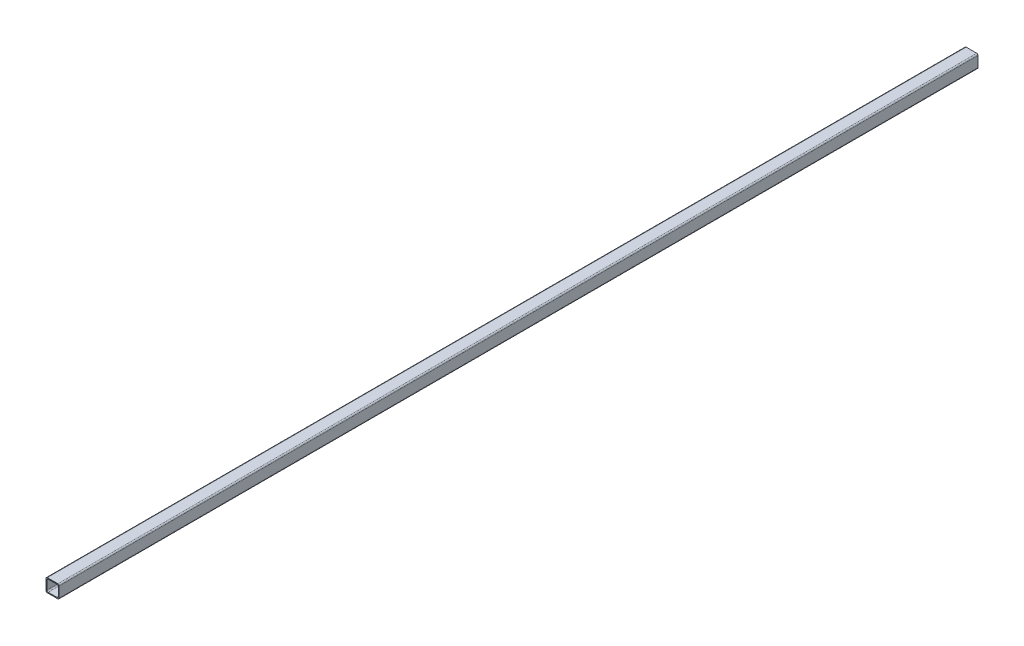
ISO-10303-21;
HEADER;
FILE_DESCRIPTION(('STEP AP214'),'2;1');
FILE_NAME('part.step','',(''),(''),'','','');
FILE_SCHEMA(('AUTOMOTIVE_DESIGN { 1 0 10303 214 1 1 1 1 }'));
ENDSEC;
DATA;
#1=APPLICATION_CONTEXT('core data for automotive mechanical design processes');
#2=APPLICATION_PROTOCOL_DEFINITION('international standard','automotive_design',2000,#1);
#3=PRODUCT_CONTEXT('',#1,'mechanical');
#4=PRODUCT('Part','Part','',(#3));
#5=PRODUCT_RELATED_PRODUCT_CATEGORY('part','',(#4));
#6=PRODUCT_DEFINITION_FORMATION('','',#4);
#7=PRODUCT_DEFINITION_CONTEXT('part definition',#1,'design');
#8=PRODUCT_DEFINITION('design','',#6,#7);
#9=PRODUCT_DEFINITION_SHAPE('','',#8);
#10=(LENGTH_UNIT() NAMED_UNIT(*) SI_UNIT(.MILLI.,.METRE.));
#11=(NAMED_UNIT(*) PLANE_ANGLE_UNIT() SI_UNIT($,.RADIAN.));
#12=(NAMED_UNIT(*) SI_UNIT($,.STERADIAN.) SOLID_ANGLE_UNIT());
#13=UNCERTAINTY_MEASURE_WITH_UNIT(LENGTH_MEASURE(1.E-05),#10,'distance_accuracy_value','');
#14=(GEOMETRIC_REPRESENTATION_CONTEXT(3) GLOBAL_UNCERTAINTY_ASSIGNED_CONTEXT((#13)) GLOBAL_UNIT_ASSIGNED_CONTEXT((#10,
#11,#12)) REPRESENTATION_CONTEXT('',''));
#15=CARTESIAN_POINT('',(0.,0.,0.));
#16=DIRECTION('',(0.,0.,1.));
#17=DIRECTION('',(1.,0.,0.));
#18=AXIS2_PLACEMENT_3D('',#15,#16,#17);
#19=CARTESIAN_POINT('',(0.,0.,2100.));
#20=DIRECTION('',(0.,0.,1.));
#21=DIRECTION('',(1.,0.,0.));
#22=AXIS2_PLACEMENT_3D('',#19,#20,#21);
#23=PLANE('',#22);
#24=DIRECTION('',(0.,-1.,0.));
#25=VECTOR('',#24,1.);
#26=CARTESIAN_POINT('',(0.,0.,2100.));
#27=LINE('',#26,#25);
#28=CARTESIAN_POINT('',(0.,27.,2100.));
#29=VERTEX_POINT('',#28);
#30=CARTESIAN_POINT('',(0.,3.,2100.));
#31=VERTEX_POINT('',#30);
#32=EDGE_CURVE('E218',#29,#31,#27,.T.);
#33=ORIENTED_EDGE('',*,*,#32,.T.);
#34=CARTESIAN_POINT('',(3.,3.,2100.));
#35=DIRECTION('',(0.,0.,1.));
#36=DIRECTION('',(1.,0.,0.));
#37=AXIS2_PLACEMENT_3D('',#34,#35,#36);
#38=CIRCLE('',#37,3.);
#39=CARTESIAN_POINT('',(3.,0.,2100.));
#40=VERTEX_POINT('',#39);
#41=EDGE_CURVE('E237',#31,#40,#38,.T.);
#42=ORIENTED_EDGE('',*,*,#41,.T.);
#43=DIRECTION('',(1.,0.,0.));
#44=VECTOR('',#43,1.);
#45=CARTESIAN_POINT('',(0.,0.,2100.));
#46=LINE('',#45,#44);
#47=CARTESIAN_POINT('',(27.,0.,2100.));
#48=VERTEX_POINT('',#47);
#49=EDGE_CURVE('E198',#40,#48,#46,.T.);
#50=ORIENTED_EDGE('',*,*,#49,.T.);
#51=CARTESIAN_POINT('',(27.,3.,2100.));
#52=DIRECTION('',(0.,0.,1.));
#53=DIRECTION('',(1.,0.,0.));
#54=AXIS2_PLACEMENT_3D('',#51,#52,#53);
#55=CIRCLE('',#54,3.);
#56=CARTESIAN_POINT('',(30.,3.,2100.));
#57=VERTEX_POINT('',#56);
#58=EDGE_CURVE('E235',#48,#57,#55,.T.);
#59=ORIENTED_EDGE('',*,*,#58,.T.);
#60=DIRECTION('',(0.,1.,0.));
#61=VECTOR('',#60,1.);
#62=CARTESIAN_POINT('',(30.,0.,2100.));
#63=LINE('',#62,#61);
#64=CARTESIAN_POINT('',(30.,27.,2100.));
#65=VERTEX_POINT('',#64);
#66=EDGE_CURVE('E326',#57,#65,#63,.T.);
#67=ORIENTED_EDGE('',*,*,#66,.T.);
#68=CARTESIAN_POINT('',(27.,27.,2100.));
#69=DIRECTION('',(0.,0.,1.));
#70=DIRECTION('',(1.,0.,0.));
#71=AXIS2_PLACEMENT_3D('',#68,#69,#70);
#72=CIRCLE('',#71,3.);
#73=CARTESIAN_POINT('',(27.,30.,2100.));
#74=VERTEX_POINT('',#73);
#75=EDGE_CURVE('E233',#65,#74,#72,.T.);
#76=ORIENTED_EDGE('',*,*,#75,.T.);
#77=DIRECTION('',(-1.,0.,0.));
#78=VECTOR('',#77,1.);
#79=CARTESIAN_POINT('',(0.,30.,2100.));
#80=LINE('',#79,#78);
#81=CARTESIAN_POINT('',(3.,30.,2100.));
#82=VERTEX_POINT('',#81);
#83=EDGE_CURVE('E220',#74,#82,#80,.T.);
#84=ORIENTED_EDGE('',*,*,#83,.T.);
#85=CARTESIAN_POINT('',(3.,27.,2100.));
#86=DIRECTION('',(0.,0.,1.));
#87=DIRECTION('',(1.,0.,0.));
#88=AXIS2_PLACEMENT_3D('',#85,#86,#87);
#89=CIRCLE('',#88,3.);
#90=EDGE_CURVE('E231',#82,#29,#89,.T.);
#91=ORIENTED_EDGE('',*,*,#90,.T.);
#92=EDGE_LOOP('',(#33,#42,#50,#59,#67,#76,#84,#91));
#93=FACE_BOUND('',#92,.T.);
#94=DIRECTION('',(1.,0.,0.));
#95=VECTOR('',#94,1.);
#96=CARTESIAN_POINT('',(0.,2.,2100.));
#97=LINE('',#96,#95);
#98=CARTESIAN_POINT('',(5.,2.,2100.));
#99=VERTEX_POINT('',#98);
#100=CARTESIAN_POINT('',(25.,2.,2100.));
#101=VERTEX_POINT('',#100);
#102=EDGE_CURVE('E307',#99,#101,#97,.T.);
#103=ORIENTED_EDGE('',*,*,#102,.F.);
#104=CARTESIAN_POINT('',(5.,5.,2100.));
#105=DIRECTION('',(0.,0.,1.));
#106=DIRECTION('',(1.,0.,0.));
#107=AXIS2_PLACEMENT_3D('',#104,#105,#106);
#108=CIRCLE('',#107,3.);
#109=CARTESIAN_POINT('',(2.,5.,2100.));
#110=VERTEX_POINT('',#109);
#111=EDGE_CURVE('E12',#99,#110,#108,.F.);
#112=ORIENTED_EDGE('',*,*,#111,.T.);
#113=DIRECTION('',(0.,-1.,0.));
#114=VECTOR('',#113,1.);
#115=CARTESIAN_POINT('',(2.,30.,2100.));
#116=LINE('',#115,#114);
#117=CARTESIAN_POINT('',(2.,25.,2100.));
#118=VERTEX_POINT('',#117);
#119=EDGE_CURVE('E305',#118,#110,#116,.T.);
#120=ORIENTED_EDGE('',*,*,#119,.F.);
#121=CARTESIAN_POINT('',(5.,25.,2100.));
#122=DIRECTION('',(0.,0.,1.));
#123=DIRECTION('',(1.,0.,0.));
#124=AXIS2_PLACEMENT_3D('',#121,#122,#123);
#125=CIRCLE('',#124,3.);
#126=CARTESIAN_POINT('',(5.,28.,2100.));
#127=VERTEX_POINT('',#126);
#128=EDGE_CURVE('E283',#118,#127,#125,.F.);
#129=ORIENTED_EDGE('',*,*,#128,.T.);
#130=DIRECTION('',(-1.,0.,0.));
#131=VECTOR('',#130,1.);
#132=CARTESIAN_POINT('',(0.,28.,2100.));
#133=LINE('',#132,#131);
#134=CARTESIAN_POINT('',(25.,28.,2100.));
#135=VERTEX_POINT('',#134);
#136=EDGE_CURVE('E212',#135,#127,#133,.T.);
#137=ORIENTED_EDGE('',*,*,#136,.F.);
#138=CARTESIAN_POINT('',(25.,25.,2100.));
#139=DIRECTION('',(0.,0.,1.));
#140=DIRECTION('',(1.,0.,0.));
#141=AXIS2_PLACEMENT_3D('',#138,#139,#140);
#142=CIRCLE('',#141,3.);
#143=CARTESIAN_POINT('',(28.,25.,2100.));
#144=VERTEX_POINT('',#143);
#145=EDGE_CURVE('E79',#135,#144,#142,.F.);
#146=ORIENTED_EDGE('',*,*,#145,.T.);
#147=DIRECTION('',(0.,1.,0.));
#148=VECTOR('',#147,1.);
#149=CARTESIAN_POINT('',(28.,30.,2100.));
#150=LINE('',#149,#148);
#151=CARTESIAN_POINT('',(28.,5.,2100.));
#152=VERTEX_POINT('',#151);
#153=EDGE_CURVE('E313',#152,#144,#150,.T.);
#154=ORIENTED_EDGE('',*,*,#153,.F.);
#155=CARTESIAN_POINT('',(25.,5.,2100.));
#156=DIRECTION('',(0.,0.,1.));
#157=DIRECTION('',(1.,0.,0.));
#158=AXIS2_PLACEMENT_3D('',#155,#156,#157);
#159=CIRCLE('',#158,3.);
#160=EDGE_CURVE('E276',#152,#101,#159,.F.);
#161=ORIENTED_EDGE('',*,*,#160,.T.);
#162=EDGE_LOOP('',(#103,#112,#120,#129,#137,#146,#154,#161));
#163=FACE_BOUND('',#162,.T.);
#164=ADVANCED_FACE('F64',(#93,#163),#23,.T.);
#165=CARTESIAN_POINT('',(0.,0.,0.));
#166=DIRECTION('',(0.,0.,1.));
#167=DIRECTION('',(1.,0.,0.));
#168=AXIS2_PLACEMENT_3D('',#165,#166,#167);
#169=PLANE('',#168);
#170=DIRECTION('',(1.,0.,0.));
#171=VECTOR('',#170,1.);
#172=CARTESIAN_POINT('',(0.,0.,0.));
#173=LINE('',#172,#171);
#174=CARTESIAN_POINT('',(3.,0.,0.));
#175=VERTEX_POINT('',#174);
#176=CARTESIAN_POINT('',(27.,0.,0.));
#177=VERTEX_POINT('',#176);
#178=EDGE_CURVE('E195',#175,#177,#173,.T.);
#179=ORIENTED_EDGE('',*,*,#178,.F.);
#180=CARTESIAN_POINT('',(3.,3.,0.));
#181=DIRECTION('',(0.,0.,1.));
#182=DIRECTION('',(1.,0.,0.));
#183=AXIS2_PLACEMENT_3D('',#180,#181,#182);
#184=CIRCLE('',#183,3.);
#185=CARTESIAN_POINT('',(0.,3.,0.));
#186=VERTEX_POINT('',#185);
#187=EDGE_CURVE('E178',#175,#186,#184,.F.);
#188=ORIENTED_EDGE('',*,*,#187,.T.);
#189=DIRECTION('',(0.,-1.,0.));
#190=VECTOR('',#189,1.);
#191=CARTESIAN_POINT('',(0.,0.,0.));
#192=LINE('',#191,#190);
#193=CARTESIAN_POINT('',(0.,27.,0.));
#194=VERTEX_POINT('',#193);
#195=EDGE_CURVE('E207',#194,#186,#192,.T.);
#196=ORIENTED_EDGE('',*,*,#195,.F.);
#197=CARTESIAN_POINT('',(3.,27.,0.));
#198=DIRECTION('',(0.,0.,1.));
#199=DIRECTION('',(1.,0.,0.));
#200=AXIS2_PLACEMENT_3D('',#197,#198,#199);
#201=CIRCLE('',#200,3.);
#202=CARTESIAN_POINT('',(3.,30.,0.));
#203=VERTEX_POINT('',#202);
#204=EDGE_CURVE('E200',#194,#203,#201,.F.);
#205=ORIENTED_EDGE('',*,*,#204,.T.);
#206=DIRECTION('',(-1.,0.,0.));
#207=VECTOR('',#206,1.);
#208=CARTESIAN_POINT('',(0.,30.,0.));
#209=LINE('',#208,#207);
#210=CARTESIAN_POINT('',(27.,30.,0.));
#211=VERTEX_POINT('',#210);
#212=EDGE_CURVE('E210',#211,#203,#209,.T.);
#213=ORIENTED_EDGE('',*,*,#212,.F.);
#214=CARTESIAN_POINT('',(27.,27.,0.));
#215=DIRECTION('',(0.,0.,1.));
#216=DIRECTION('',(1.,0.,0.));
#217=AXIS2_PLACEMENT_3D('',#214,#215,#216);
#218=CIRCLE('',#217,3.);
#219=CARTESIAN_POINT('',(30.,27.,0.));
#220=VERTEX_POINT('',#219);
#221=EDGE_CURVE('E223',#211,#220,#218,.F.);
#222=ORIENTED_EDGE('',*,*,#221,.T.);
#223=DIRECTION('',(0.,1.,0.));
#224=VECTOR('',#223,1.);
#225=CARTESIAN_POINT('',(30.,0.,0.));
#226=LINE('',#225,#224);
#227=CARTESIAN_POINT('',(30.,3.,0.));
#228=VERTEX_POINT('',#227);
#229=EDGE_CURVE('E206',#228,#220,#226,.T.);
#230=ORIENTED_EDGE('',*,*,#229,.F.);
#231=CARTESIAN_POINT('',(27.,3.,0.));
#232=DIRECTION('',(0.,0.,1.));
#233=DIRECTION('',(1.,0.,0.));
#234=AXIS2_PLACEMENT_3D('',#231,#232,#233);
#235=CIRCLE('',#234,3.);
#236=EDGE_CURVE('E189',#228,#177,#235,.F.);
#237=ORIENTED_EDGE('',*,*,#236,.T.);
#238=EDGE_LOOP('',(#179,#188,#196,#205,#213,#222,#230,#237));
#239=FACE_BOUND('',#238,.T.);
#240=DIRECTION('',(-1.,0.,0.));
#241=VECTOR('',#240,1.);
#242=CARTESIAN_POINT('',(0.,28.,0.));
#243=LINE('',#242,#241);
#244=CARTESIAN_POINT('',(25.,28.,0.));
#245=VERTEX_POINT('',#244);
#246=CARTESIAN_POINT('',(5.,28.,0.));
#247=VERTEX_POINT('',#246);
#248=EDGE_CURVE('E311',#245,#247,#243,.T.);
#249=ORIENTED_EDGE('',*,*,#248,.T.);
#250=CARTESIAN_POINT('',(5.,25.,0.));
#251=DIRECTION('',(0.,0.,1.));
#252=DIRECTION('',(1.,0.,0.));
#253=AXIS2_PLACEMENT_3D('',#250,#251,#252);
#254=CIRCLE('',#253,3.);
#255=CARTESIAN_POINT('',(2.,25.,0.));
#256=VERTEX_POINT('',#255);
#257=EDGE_CURVE('E281',#247,#256,#254,.T.);
#258=ORIENTED_EDGE('',*,*,#257,.T.);
#259=DIRECTION('',(0.,-1.,0.));
#260=VECTOR('',#259,1.);
#261=CARTESIAN_POINT('',(2.,30.,0.));
#262=LINE('',#261,#260);
#263=CARTESIAN_POINT('',(2.,5.,0.));
#264=VERTEX_POINT('',#263);
#265=EDGE_CURVE('E290',#256,#264,#262,.T.);
#266=ORIENTED_EDGE('',*,*,#265,.T.);
#267=CARTESIAN_POINT('',(5.,5.,0.));
#268=DIRECTION('',(0.,0.,1.));
#269=DIRECTION('',(1.,0.,0.));
#270=AXIS2_PLACEMENT_3D('',#267,#268,#269);
#271=CIRCLE('',#270,3.);
#272=CARTESIAN_POINT('',(5.,2.,0.));
#273=VERTEX_POINT('',#272);
#274=EDGE_CURVE('E72',#264,#273,#271,.T.);
#275=ORIENTED_EDGE('',*,*,#274,.T.);
#276=DIRECTION('',(1.,0.,0.));
#277=VECTOR('',#276,1.);
#278=CARTESIAN_POINT('',(0.,2.,0.));
#279=LINE('',#278,#277);
#280=CARTESIAN_POINT('',(25.,2.,0.));
#281=VERTEX_POINT('',#280);
#282=EDGE_CURVE('E288',#273,#281,#279,.T.);
#283=ORIENTED_EDGE('',*,*,#282,.T.);
#284=CARTESIAN_POINT('',(25.,5.,0.));
#285=DIRECTION('',(0.,0.,1.));
#286=DIRECTION('',(1.,0.,0.));
#287=AXIS2_PLACEMENT_3D('',#284,#285,#286);
#288=CIRCLE('',#287,3.);
#289=CARTESIAN_POINT('',(28.,5.,0.));
#290=VERTEX_POINT('',#289);
#291=EDGE_CURVE('E274',#281,#290,#288,.T.);
#292=ORIENTED_EDGE('',*,*,#291,.T.);
#293=DIRECTION('',(0.,1.,0.));
#294=VECTOR('',#293,1.);
#295=CARTESIAN_POINT('',(28.,30.,0.));
#296=LINE('',#295,#294);
#297=CARTESIAN_POINT('',(28.,25.,0.));
#298=VERTEX_POINT('',#297);
#299=EDGE_CURVE('E299',#290,#298,#296,.T.);
#300=ORIENTED_EDGE('',*,*,#299,.T.);
#301=CARTESIAN_POINT('',(25.,25.,0.));
#302=DIRECTION('',(0.,0.,1.));
#303=DIRECTION('',(1.,0.,0.));
#304=AXIS2_PLACEMENT_3D('',#301,#302,#303);
#305=CIRCLE('',#304,3.);
#306=EDGE_CURVE('E278',#298,#245,#305,.T.);
#307=ORIENTED_EDGE('',*,*,#306,.T.);
#308=EDGE_LOOP('',(#249,#258,#266,#275,#283,#292,#300,#307));
#309=FACE_BOUND('',#308,.T.);
#310=ADVANCED_FACE('F203',(#239,#309),#169,.F.);
#311=CARTESIAN_POINT('',(0.,0.,2100.));
#312=DIRECTION('',(1.,0.,0.));
#313=DIRECTION('',(0.,0.,-1.));
#314=AXIS2_PLACEMENT_3D('',#311,#312,#313);
#315=PLANE('',#314);
#316=ORIENTED_EDGE('',*,*,#195,.T.);
#317=DIRECTION('',(0.,0.,-1.));
#318=VECTOR('',#317,1.);
#319=CARTESIAN_POINT('',(0.,3.,2100.));
#320=LINE('',#319,#318);
#321=EDGE_CURVE('E183',#186,#31,#320,.F.);
#322=ORIENTED_EDGE('',*,*,#321,.T.);
#323=ORIENTED_EDGE('',*,*,#32,.F.);
#324=DIRECTION('',(0.,0.,-1.));
#325=VECTOR('',#324,1.);
#326=CARTESIAN_POINT('',(0.,27.,2100.));
#327=LINE('',#326,#325);
#328=EDGE_CURVE('E188',#29,#194,#327,.T.);
#329=ORIENTED_EDGE('',*,*,#328,.T.);
#330=EDGE_LOOP('',(#316,#322,#323,#329));
#331=FACE_BOUND('',#330,.T.);
#332=ADVANCED_FACE('F340',(#331),#315,.F.);
#333=CARTESIAN_POINT('',(0.,0.,2100.));
#334=DIRECTION('',(0.,1.,0.));
#335=DIRECTION('',(0.,0.,1.));
#336=AXIS2_PLACEMENT_3D('',#333,#334,#335);
#337=PLANE('',#336);
#338=ORIENTED_EDGE('',*,*,#49,.F.);
#339=DIRECTION('',(0.,0.,-1.));
#340=VECTOR('',#339,1.);
#341=CARTESIAN_POINT('',(3.,0.,2100.));
#342=LINE('',#341,#340);
#343=EDGE_CURVE('E182',#40,#175,#342,.T.);
#344=ORIENTED_EDGE('',*,*,#343,.T.);
#345=ORIENTED_EDGE('',*,*,#178,.T.);
#346=DIRECTION('',(0.,0.,-1.));
#347=VECTOR('',#346,1.);
#348=CARTESIAN_POINT('',(27.,0.,2100.));
#349=LINE('',#348,#347);
#350=EDGE_CURVE('E201',#177,#48,#349,.F.);
#351=ORIENTED_EDGE('',*,*,#350,.T.);
#352=EDGE_LOOP('',(#338,#344,#345,#351));
#353=FACE_BOUND('',#352,.T.);
#354=ADVANCED_FACE('F194',(#353),#337,.F.);
#355=CARTESIAN_POINT('',(30.,0.,2100.));
#356=DIRECTION('',(-1.,0.,0.));
#357=DIRECTION('',(0.,0.,1.));
#358=AXIS2_PLACEMENT_3D('',#355,#356,#357);
#359=PLANE('',#358);
#360=ORIENTED_EDGE('',*,*,#66,.F.);
#361=DIRECTION('',(0.,0.,-1.));
#362=VECTOR('',#361,1.);
#363=CARTESIAN_POINT('',(30.,3.,2100.));
#364=LINE('',#363,#362);
#365=EDGE_CURVE('E265',#57,#228,#364,.T.);
#366=ORIENTED_EDGE('',*,*,#365,.T.);
#367=ORIENTED_EDGE('',*,*,#229,.T.);
#368=DIRECTION('',(0.,0.,-1.));
#369=VECTOR('',#368,1.);
#370=CARTESIAN_POINT('',(30.,27.,2100.));
#371=LINE('',#370,#369);
#372=EDGE_CURVE('E263',#220,#65,#371,.F.);
#373=ORIENTED_EDGE('',*,*,#372,.T.);
#374=EDGE_LOOP('',(#360,#366,#367,#373));
#375=FACE_BOUND('',#374,.T.);
#376=ADVANCED_FACE('F348',(#375),#359,.F.);
#377=CARTESIAN_POINT('',(0.,30.,2100.));
#378=DIRECTION('',(0.,-1.,0.));
#379=DIRECTION('',(0.,0.,-1.));
#380=AXIS2_PLACEMENT_3D('',#377,#378,#379);
#381=PLANE('',#380);
#382=ORIENTED_EDGE('',*,*,#83,.F.);
#383=DIRECTION('',(0.,0.,-1.));
#384=VECTOR('',#383,1.);
#385=CARTESIAN_POINT('',(27.,30.,2100.));
#386=LINE('',#385,#384);
#387=EDGE_CURVE('E271',#74,#211,#386,.T.);
#388=ORIENTED_EDGE('',*,*,#387,.T.);
#389=ORIENTED_EDGE('',*,*,#212,.T.);
#390=DIRECTION('',(0.,0.,-1.));
#391=VECTOR('',#390,1.);
#392=CARTESIAN_POINT('',(3.,30.,2100.));
#393=LINE('',#392,#391);
#394=EDGE_CURVE('E269',#203,#82,#393,.F.);
#395=ORIENTED_EDGE('',*,*,#394,.T.);
#396=EDGE_LOOP('',(#382,#388,#389,#395));
#397=FACE_BOUND('',#396,.T.);
#398=ADVANCED_FACE('F342',(#397),#381,.F.);
#399=CARTESIAN_POINT('',(2.,30.,2100.));
#400=DIRECTION('',(1.,0.,0.));
#401=DIRECTION('',(0.,0.,-1.));
#402=AXIS2_PLACEMENT_3D('',#399,#400,#401);
#403=PLANE('',#402);
#404=ORIENTED_EDGE('',*,*,#265,.F.);
#405=DIRECTION('',(0.,0.,-1.));
#406=VECTOR('',#405,1.);
#407=CARTESIAN_POINT('',(2.,25.,2100.));
#408=LINE('',#407,#406);
#409=EDGE_CURVE('E260',#256,#118,#408,.F.);
#410=ORIENTED_EDGE('',*,*,#409,.T.);
#411=ORIENTED_EDGE('',*,*,#119,.T.);
#412=DIRECTION('',(0.,0.,-1.));
#413=VECTOR('',#412,1.);
#414=CARTESIAN_POINT('',(2.,5.,0.));
#415=LINE('',#414,#413);
#416=EDGE_CURVE('E256',#110,#264,#415,.T.);
#417=ORIENTED_EDGE('',*,*,#416,.T.);
#418=EDGE_LOOP('',(#404,#410,#411,#417));
#419=FACE_BOUND('',#418,.T.);
#420=ADVANCED_FACE('F309',(#419),#403,.T.);
#421=CARTESIAN_POINT('',(0.,2.,2100.));
#422=DIRECTION('',(0.,1.,0.));
#423=DIRECTION('',(0.,0.,1.));
#424=AXIS2_PLACEMENT_3D('',#421,#422,#423);
#425=PLANE('',#424);
#426=ORIENTED_EDGE('',*,*,#102,.T.);
#427=DIRECTION('',(0.,0.,-1.));
#428=VECTOR('',#427,1.);
#429=CARTESIAN_POINT('',(25.,2.,0.));
#430=LINE('',#429,#428);
#431=EDGE_CURVE('E242',#101,#281,#430,.T.);
#432=ORIENTED_EDGE('',*,*,#431,.T.);
#433=ORIENTED_EDGE('',*,*,#282,.F.);
#434=DIRECTION('',(0.,0.,-1.));
#435=VECTOR('',#434,1.);
#436=CARTESIAN_POINT('',(5.,2.,2100.));
#437=LINE('',#436,#435);
#438=EDGE_CURVE('E239',#273,#99,#437,.F.);
#439=ORIENTED_EDGE('',*,*,#438,.T.);
#440=EDGE_LOOP('',(#426,#432,#433,#439));
#441=FACE_BOUND('',#440,.T.);
#442=ADVANCED_FACE('F296',(#441),#425,.T.);
#443=CARTESIAN_POINT('',(28.,30.,2100.));
#444=DIRECTION('',(-1.,0.,0.));
#445=DIRECTION('',(0.,0.,1.));
#446=AXIS2_PLACEMENT_3D('',#443,#444,#445);
#447=PLANE('',#446);
#448=ORIENTED_EDGE('',*,*,#299,.F.);
#449=DIRECTION('',(0.,0.,-1.));
#450=VECTOR('',#449,1.);
#451=CARTESIAN_POINT('',(28.,5.,2100.));
#452=LINE('',#451,#450);
#453=EDGE_CURVE('E86',#290,#152,#452,.F.);
#454=ORIENTED_EDGE('',*,*,#453,.T.);
#455=ORIENTED_EDGE('',*,*,#153,.T.);
#456=DIRECTION('',(0.,0.,-1.));
#457=VECTOR('',#456,1.);
#458=CARTESIAN_POINT('',(28.,25.,0.));
#459=LINE('',#458,#457);
#460=EDGE_CURVE('E246',#144,#298,#459,.T.);
#461=ORIENTED_EDGE('',*,*,#460,.T.);
#462=EDGE_LOOP('',(#448,#454,#455,#461));
#463=FACE_BOUND('',#462,.T.);
#464=ADVANCED_FACE('F398',(#463),#447,.T.);
#465=CARTESIAN_POINT('',(0.,28.,2100.));
#466=DIRECTION('',(0.,-1.,0.));
#467=DIRECTION('',(0.,0.,-1.));
#468=AXIS2_PLACEMENT_3D('',#465,#466,#467);
#469=PLANE('',#468);
#470=ORIENTED_EDGE('',*,*,#248,.F.);
#471=DIRECTION('',(0.,0.,-1.));
#472=VECTOR('',#471,1.);
#473=CARTESIAN_POINT('',(25.,28.,2100.));
#474=LINE('',#473,#472);
#475=EDGE_CURVE('E254',#245,#135,#474,.F.);
#476=ORIENTED_EDGE('',*,*,#475,.T.);
#477=ORIENTED_EDGE('',*,*,#136,.T.);
#478=DIRECTION('',(0.,0.,-1.));
#479=VECTOR('',#478,1.);
#480=CARTESIAN_POINT('',(5.,28.,0.));
#481=LINE('',#480,#479);
#482=EDGE_CURVE('E251',#127,#247,#481,.T.);
#483=ORIENTED_EDGE('',*,*,#482,.T.);
#484=EDGE_LOOP('',(#470,#476,#477,#483));
#485=FACE_BOUND('',#484,.T.);
#486=ADVANCED_FACE('F381',(#485),#469,.T.);
#487=CARTESIAN_POINT('',(3.,3.,2100.));
#488=DIRECTION('',(0.,0.,-1.));
#489=DIRECTION('',(-1.,0.,0.));
#490=AXIS2_PLACEMENT_3D('',#487,#488,#489);
#491=CYLINDRICAL_SURFACE('',#490,3.);
#492=ORIENTED_EDGE('',*,*,#41,.F.);
#493=ORIENTED_EDGE('',*,*,#321,.F.);
#494=ORIENTED_EDGE('',*,*,#187,.F.);
#495=ORIENTED_EDGE('',*,*,#343,.F.);
#496=EDGE_LOOP('',(#492,#493,#494,#495));
#497=FACE_BOUND('',#496,.T.);
#498=ADVANCED_FACE('F181',(#497),#491,.T.);
#499=CARTESIAN_POINT('',(25.,5.,2100.));
#500=DIRECTION('',(0.,0.,1.));
#501=DIRECTION('',(1.,0.,0.));
#502=AXIS2_PLACEMENT_3D('',#499,#500,#501);
#503=CYLINDRICAL_SURFACE('',#502,3.);
#504=ORIENTED_EDGE('',*,*,#160,.F.);
#505=ORIENTED_EDGE('',*,*,#453,.F.);
#506=ORIENTED_EDGE('',*,*,#291,.F.);
#507=ORIENTED_EDGE('',*,*,#431,.F.);
#508=EDGE_LOOP('',(#504,#505,#506,#507));
#509=FACE_BOUND('',#508,.T.);
#510=ADVANCED_FACE('F380',(#509),#503,.F.);
#511=CARTESIAN_POINT('',(25.,25.,2100.));
#512=DIRECTION('',(0.,0.,1.));
#513=DIRECTION('',(1.,0.,0.));
#514=AXIS2_PLACEMENT_3D('',#511,#512,#513);
#515=CYLINDRICAL_SURFACE('',#514,3.);
#516=ORIENTED_EDGE('',*,*,#145,.F.);
#517=ORIENTED_EDGE('',*,*,#475,.F.);
#518=ORIENTED_EDGE('',*,*,#306,.F.);
#519=ORIENTED_EDGE('',*,*,#460,.F.);
#520=EDGE_LOOP('',(#516,#517,#518,#519));
#521=FACE_BOUND('',#520,.T.);
#522=ADVANCED_FACE('F384',(#521),#515,.F.);
#523=CARTESIAN_POINT('',(5.,25.,2100.));
#524=DIRECTION('',(0.,0.,1.));
#525=DIRECTION('',(1.,0.,0.));
#526=AXIS2_PLACEMENT_3D('',#523,#524,#525);
#527=CYLINDRICAL_SURFACE('',#526,3.);
#528=ORIENTED_EDGE('',*,*,#128,.F.);
#529=ORIENTED_EDGE('',*,*,#409,.F.);
#530=ORIENTED_EDGE('',*,*,#257,.F.);
#531=ORIENTED_EDGE('',*,*,#482,.F.);
#532=EDGE_LOOP('',(#528,#529,#530,#531));
#533=FACE_BOUND('',#532,.T.);
#534=ADVANCED_FACE('F359',(#533),#527,.F.);
#535=CARTESIAN_POINT('',(5.,5.,2100.));
#536=DIRECTION('',(0.,0.,1.));
#537=DIRECTION('',(1.,0.,0.));
#538=AXIS2_PLACEMENT_3D('',#535,#536,#537);
#539=CYLINDRICAL_SURFACE('',#538,3.);
#540=ORIENTED_EDGE('',*,*,#111,.F.);
#541=ORIENTED_EDGE('',*,*,#438,.F.);
#542=ORIENTED_EDGE('',*,*,#274,.F.);
#543=ORIENTED_EDGE('',*,*,#416,.F.);
#544=EDGE_LOOP('',(#540,#541,#542,#543));
#545=FACE_BOUND('',#544,.T.);
#546=ADVANCED_FACE('F302',(#545),#539,.F.);
#547=CARTESIAN_POINT('',(27.,3.,2100.));
#548=DIRECTION('',(0.,0.,-1.));
#549=DIRECTION('',(-1.,0.,0.));
#550=AXIS2_PLACEMENT_3D('',#547,#548,#549);
#551=CYLINDRICAL_SURFACE('',#550,3.);
#552=ORIENTED_EDGE('',*,*,#58,.F.);
#553=ORIENTED_EDGE('',*,*,#350,.F.);
#554=ORIENTED_EDGE('',*,*,#236,.F.);
#555=ORIENTED_EDGE('',*,*,#365,.F.);
#556=EDGE_LOOP('',(#552,#553,#554,#555));
#557=FACE_BOUND('',#556,.T.);
#558=ADVANCED_FACE('F352',(#557),#551,.T.);
#559=CARTESIAN_POINT('',(27.,27.,2100.));
#560=DIRECTION('',(0.,0.,-1.));
#561=DIRECTION('',(-1.,0.,0.));
#562=AXIS2_PLACEMENT_3D('',#559,#560,#561);
#563=CYLINDRICAL_SURFACE('',#562,3.);
#564=ORIENTED_EDGE('',*,*,#75,.F.);
#565=ORIENTED_EDGE('',*,*,#372,.F.);
#566=ORIENTED_EDGE('',*,*,#221,.F.);
#567=ORIENTED_EDGE('',*,*,#387,.F.);
#568=EDGE_LOOP('',(#564,#565,#566,#567));
#569=FACE_BOUND('',#568,.T.);
#570=ADVANCED_FACE('F344',(#569),#563,.T.);
#571=CARTESIAN_POINT('',(3.,27.,2100.));
#572=DIRECTION('',(0.,0.,-1.));
#573=DIRECTION('',(-1.,0.,0.));
#574=AXIS2_PLACEMENT_3D('',#571,#572,#573);
#575=CYLINDRICAL_SURFACE('',#574,3.);
#576=ORIENTED_EDGE('',*,*,#90,.F.);
#577=ORIENTED_EDGE('',*,*,#394,.F.);
#578=ORIENTED_EDGE('',*,*,#204,.F.);
#579=ORIENTED_EDGE('',*,*,#328,.F.);
#580=EDGE_LOOP('',(#576,#577,#578,#579));
#581=FACE_BOUND('',#580,.T.);
#582=ADVANCED_FACE('F66',(#581),#575,.T.);
#583=CLOSED_SHELL('',(#164,#310,#332,#354,#376,#398,#420,#442,#464,#486,#498,#510,#522,#534,
#546,#558,#570,#582));
#584=MANIFOLD_SOLID_BREP('B2',#583);
#585=ADVANCED_BREP_SHAPE_REPRESENTATION('',(#18,#584),#14);
#586=SHAPE_DEFINITION_REPRESENTATION(#9,#585);
ENDSEC;
END-ISO-10303-21;
